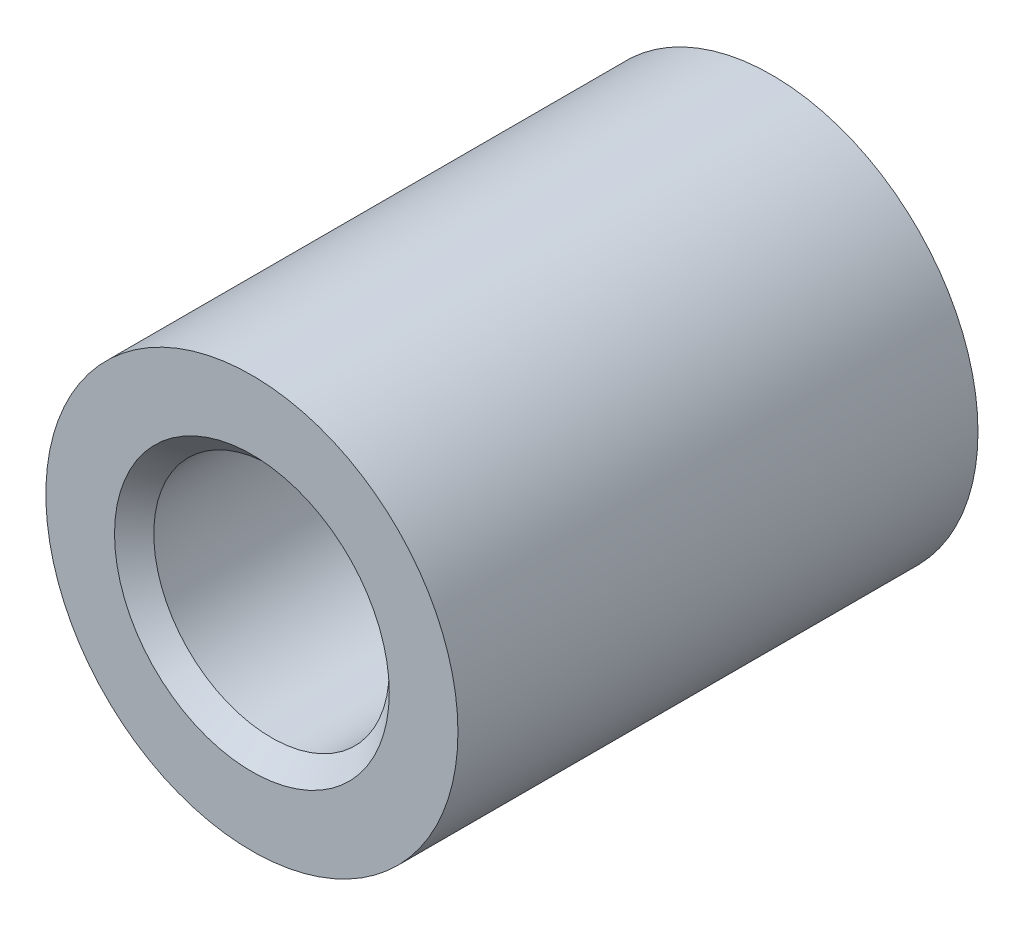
ISO-10303-21;
HEADER;
FILE_DESCRIPTION(('STEP AP214'),'2;1');
FILE_NAME('part.step','',(''),(''),'','','');
FILE_SCHEMA(('AUTOMOTIVE_DESIGN { 1 0 10303 214 1 1 1 1 }'));
ENDSEC;
DATA;
#1=APPLICATION_CONTEXT('core data for automotive mechanical design processes');
#2=APPLICATION_PROTOCOL_DEFINITION('international standard','automotive_design',2000,#1);
#3=PRODUCT_CONTEXT('',#1,'mechanical');
#4=PRODUCT('Part','Part','',(#3));
#5=PRODUCT_RELATED_PRODUCT_CATEGORY('part','',(#4));
#6=PRODUCT_DEFINITION_FORMATION('','',#4);
#7=PRODUCT_DEFINITION_CONTEXT('part definition',#1,'design');
#8=PRODUCT_DEFINITION('design','',#6,#7);
#9=PRODUCT_DEFINITION_SHAPE('','',#8);
#10=(LENGTH_UNIT() NAMED_UNIT(*) SI_UNIT(.MILLI.,.METRE.));
#11=(NAMED_UNIT(*) PLANE_ANGLE_UNIT() SI_UNIT($,.RADIAN.));
#12=(NAMED_UNIT(*) SI_UNIT($,.STERADIAN.) SOLID_ANGLE_UNIT());
#13=UNCERTAINTY_MEASURE_WITH_UNIT(LENGTH_MEASURE(1.E-05),#10,'distance_accuracy_value','');
#14=(GEOMETRIC_REPRESENTATION_CONTEXT(3) GLOBAL_UNCERTAINTY_ASSIGNED_CONTEXT((#13)) GLOBAL_UNIT_ASSIGNED_CONTEXT((#10,
#11,#12)) REPRESENTATION_CONTEXT('',''));
#15=CARTESIAN_POINT('',(0.,0.,0.));
#16=DIRECTION('',(0.,0.,1.));
#17=DIRECTION('',(1.,0.,0.));
#18=AXIS2_PLACEMENT_3D('',#15,#16,#17);
#19=CARTESIAN_POINT('',(0.,0.,26.5));
#20=DIRECTION('',(0.,0.,1.));
#21=DIRECTION('',(1.,0.,0.));
#22=AXIS2_PLACEMENT_3D('',#19,#20,#21);
#23=PLANE('',#22);
#24=CARTESIAN_POINT('',(0.,0.,26.5));
#25=DIRECTION('',(0.,0.,1.));
#26=DIRECTION('',(1.,0.,0.));
#27=AXIS2_PLACEMENT_3D('',#24,#25,#26);
#28=CIRCLE('',#27,7.);
#29=CARTESIAN_POINT('',(7.,0.,26.5));
#30=VERTEX_POINT('',#29);
#31=EDGE_CURVE('E10',#30,#30,#28,.F.);
#32=ORIENTED_EDGE('',*,*,#31,.T.);
#33=EDGE_LOOP('',(#32));
#34=FACE_BOUND('',#33,.T.);
#35=CARTESIAN_POINT('',(0.,0.,26.5));
#36=DIRECTION('',(0.,0.,1.));
#37=DIRECTION('',(1.,0.,0.));
#38=AXIS2_PLACEMENT_3D('',#35,#36,#37);
#39=CIRCLE('',#38,10.5);
#40=CARTESIAN_POINT('',(10.5,0.,26.5));
#41=VERTEX_POINT('',#40);
#42=EDGE_CURVE('E357',#41,#41,#39,.T.);
#43=ORIENTED_EDGE('',*,*,#42,.T.);
#44=EDGE_LOOP('',(#43));
#45=FACE_BOUND('',#44,.T.);
#46=ADVANCED_FACE('F346',(#34,#45),#23,.T.);
#47=CARTESIAN_POINT('',(0.,0.,0.));
#48=DIRECTION('',(0.,0.,1.));
#49=DIRECTION('',(1.,0.,0.));
#50=AXIS2_PLACEMENT_3D('',#47,#48,#49);
#51=PLANE('',#50);
#52=CARTESIAN_POINT('',(0.,0.,0.));
#53=DIRECTION('',(0.,0.,1.));
#54=DIRECTION('',(1.,0.,0.));
#55=AXIS2_PLACEMENT_3D('',#52,#53,#54);
#56=CIRCLE('',#55,10.5);
#57=CARTESIAN_POINT('',(10.5,0.,0.));
#58=VERTEX_POINT('',#57);
#59=EDGE_CURVE('E361',#58,#58,#56,.T.);
#60=ORIENTED_EDGE('',*,*,#59,.F.);
#61=EDGE_LOOP('',(#60));
#62=FACE_BOUND('',#61,.T.);
#63=CARTESIAN_POINT('',(0.,0.,0.));
#64=DIRECTION('',(0.,0.,1.));
#65=DIRECTION('',(1.,0.,0.));
#66=AXIS2_PLACEMENT_3D('',#63,#64,#65);
#67=CIRCLE('',#66,6.);
#68=CARTESIAN_POINT('',(6.,0.,0.));
#69=VERTEX_POINT('',#68);
#70=EDGE_CURVE('E366',#69,#69,#67,.T.);
#71=ORIENTED_EDGE('',*,*,#70,.T.);
#72=EDGE_LOOP('',(#71));
#73=FACE_BOUND('',#72,.T.);
#74=ADVANCED_FACE('F370',(#62,#73),#51,.F.);
#75=CARTESIAN_POINT('',(0.,0.,26.5));
#76=DIRECTION('',(0.,0.,-1.));
#77=DIRECTION('',(-1.,0.,0.));
#78=AXIS2_PLACEMENT_3D('',#75,#76,#77);
#79=CYLINDRICAL_SURFACE('',#78,10.5);
#80=ORIENTED_EDGE('',*,*,#42,.F.);
#81=EDGE_LOOP('',(#80));
#82=FACE_BOUND('',#81,.T.);
#83=ORIENTED_EDGE('',*,*,#59,.T.);
#84=EDGE_LOOP('',(#83));
#85=FACE_BOUND('',#84,.T.);
#86=ADVANCED_FACE('F348',(#82,#85),#79,.T.);
#87=CARTESIAN_POINT('',(0.,0.,26.5));
#88=DIRECTION('',(0.,0.,-1.));
#89=DIRECTION('',(-1.,0.,0.));
#90=AXIS2_PLACEMENT_3D('',#87,#88,#89);
#91=CYLINDRICAL_SURFACE('',#90,6.);
#92=CARTESIAN_POINT('',(0.,0.,25.5));
#93=DIRECTION('',(0.,0.,1.));
#94=DIRECTION('',(1.,0.,0.));
#95=AXIS2_PLACEMENT_3D('',#92,#93,#94);
#96=CIRCLE('',#95,6.);
#97=CARTESIAN_POINT('',(6.,0.,25.5));
#98=VERTEX_POINT('',#97);
#99=EDGE_CURVE('E353',#98,#98,#96,.T.);
#100=ORIENTED_EDGE('',*,*,#99,.T.);
#101=EDGE_LOOP('',(#100));
#102=FACE_BOUND('',#101,.T.);
#103=ORIENTED_EDGE('',*,*,#70,.F.);
#104=EDGE_LOOP('',(#103));
#105=FACE_BOUND('',#104,.T.);
#106=ADVANCED_FACE('F372',(#102,#105),#91,.F.);
#107=CARTESIAN_POINT('',(0.,0.,25.5));
#108=DIRECTION('',(0.,0.,1.));
#109=DIRECTION('',(1.,0.,0.));
#110=AXIS2_PLACEMENT_3D('',#107,#108,#109);
#111=CONICAL_SURFACE('',#110,6.,0.785398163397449);
#112=ORIENTED_EDGE('',*,*,#31,.F.);
#113=EDGE_LOOP('',(#112));
#114=FACE_BOUND('',#113,.T.);
#115=ORIENTED_EDGE('',*,*,#99,.F.);
#116=EDGE_LOOP('',(#115));
#117=FACE_BOUND('',#116,.T.);
#118=ADVANCED_FACE('F374',(#114,#117),#111,.F.);
#119=CLOSED_SHELL('',(#46,#74,#86,#106,#118));
#120=MANIFOLD_SOLID_BREP('B2',#119);
#121=ADVANCED_BREP_SHAPE_REPRESENTATION('',(#18,#120),#14);
#122=SHAPE_DEFINITION_REPRESENTATION(#9,#121);
ENDSEC;
END-ISO-10303-21;
